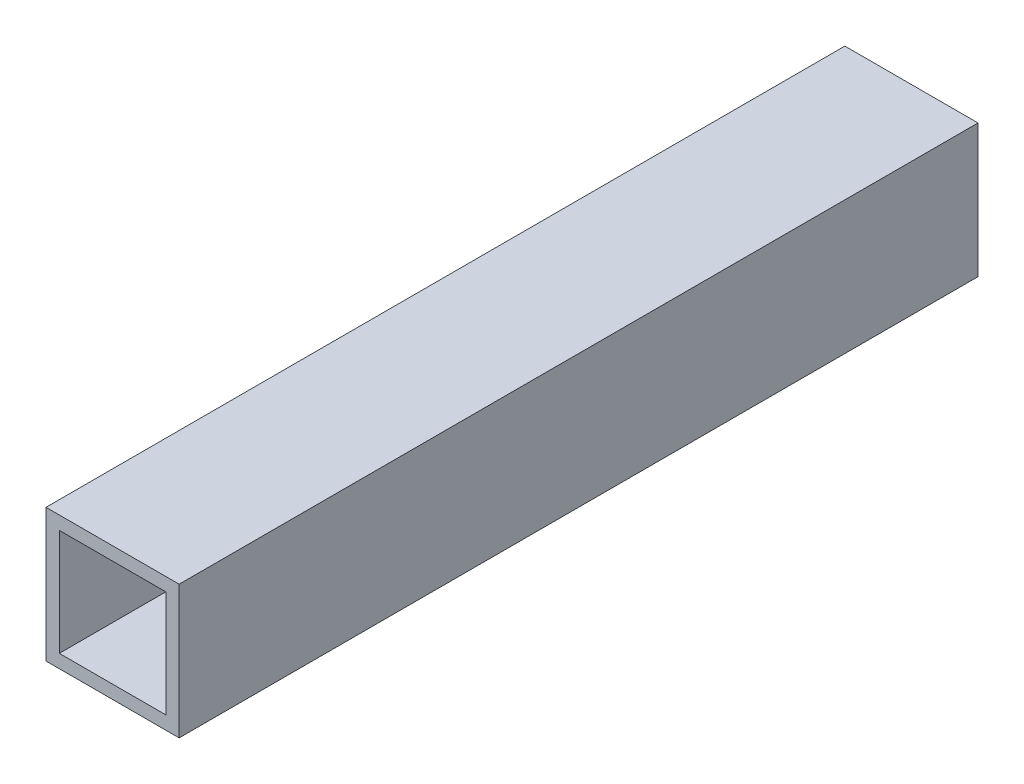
ISO-10303-21;
HEADER;
FILE_DESCRIPTION(('STEP AP214'),'2;1');
FILE_NAME('part.step','',(''),(''),'','','');
FILE_SCHEMA(('AUTOMOTIVE_DESIGN { 1 0 10303 214 1 1 1 1 }'));
ENDSEC;
DATA;
#1=APPLICATION_CONTEXT('core data for automotive mechanical design processes');
#2=APPLICATION_PROTOCOL_DEFINITION('international standard','automotive_design',2000,#1);
#3=PRODUCT_CONTEXT('',#1,'mechanical');
#4=PRODUCT('Part','Part','',(#3));
#5=PRODUCT_RELATED_PRODUCT_CATEGORY('part','',(#4));
#6=PRODUCT_DEFINITION_FORMATION('','',#4);
#7=PRODUCT_DEFINITION_CONTEXT('part definition',#1,'design');
#8=PRODUCT_DEFINITION('design','',#6,#7);
#9=PRODUCT_DEFINITION_SHAPE('','',#8);
#10=(LENGTH_UNIT() NAMED_UNIT(*) SI_UNIT(.MILLI.,.METRE.));
#11=(NAMED_UNIT(*) PLANE_ANGLE_UNIT() SI_UNIT($,.RADIAN.));
#12=(NAMED_UNIT(*) SI_UNIT($,.STERADIAN.) SOLID_ANGLE_UNIT());
#13=UNCERTAINTY_MEASURE_WITH_UNIT(LENGTH_MEASURE(1.E-05),#10,'distance_accuracy_value','');
#14=(GEOMETRIC_REPRESENTATION_CONTEXT(3) GLOBAL_UNCERTAINTY_ASSIGNED_CONTEXT((#13)) GLOBAL_UNIT_ASSIGNED_CONTEXT((#10,
#11,#12)) REPRESENTATION_CONTEXT('',''));
#15=CARTESIAN_POINT('',(0.,0.,0.));
#16=DIRECTION('',(0.,0.,1.));
#17=DIRECTION('',(1.,0.,0.));
#18=AXIS2_PLACEMENT_3D('',#15,#16,#17);
#19=CARTESIAN_POINT('',(0.,0.,300.));
#20=DIRECTION('',(0.,0.,1.));
#21=DIRECTION('',(1.,0.,0.));
#22=AXIS2_PLACEMENT_3D('',#19,#20,#21);
#23=PLANE('',#22);
#24=DIRECTION('',(0.,1.,0.));
#25=VECTOR('',#24,1.);
#26=CARTESIAN_POINT('',(0.,0.,300.));
#27=LINE('',#26,#25);
#28=CARTESIAN_POINT('',(0.,0.,300.));
#29=VERTEX_POINT('',#28);
#30=CARTESIAN_POINT('',(0.,50.,300.));
#31=VERTEX_POINT('',#30);
#32=EDGE_CURVE('E136',#29,#31,#27,.T.);
#33=ORIENTED_EDGE('',*,*,#32,.T.);
#34=DIRECTION('',(-1.,0.,0.));
#35=VECTOR('',#34,1.);
#36=CARTESIAN_POINT('',(0.,50.,300.));
#37=LINE('',#36,#35);
#38=CARTESIAN_POINT('',(-50.,50.,300.));
#39=VERTEX_POINT('',#38);
#40=EDGE_CURVE('E139',#31,#39,#37,.T.);
#41=ORIENTED_EDGE('',*,*,#40,.T.);
#42=DIRECTION('',(0.,-1.,0.));
#43=VECTOR('',#42,1.);
#44=CARTESIAN_POINT('',(-50.,0.,300.));
#45=LINE('',#44,#43);
#46=CARTESIAN_POINT('',(-50.,0.,300.));
#47=VERTEX_POINT('',#46);
#48=EDGE_CURVE('E142',#39,#47,#45,.T.);
#49=ORIENTED_EDGE('',*,*,#48,.T.);
#50=DIRECTION('',(1.,0.,0.));
#51=VECTOR('',#50,1.);
#52=CARTESIAN_POINT('',(0.,0.,300.));
#53=LINE('',#52,#51);
#54=EDGE_CURVE('E144',#47,#29,#53,.T.);
#55=ORIENTED_EDGE('',*,*,#54,.T.);
#56=EDGE_LOOP('',(#33,#41,#49,#55));
#57=FACE_BOUND('',#56,.T.);
#58=DIRECTION('',(-1.,0.,0.));
#59=VECTOR('',#58,1.);
#60=CARTESIAN_POINT('',(-5.,45.,300.));
#61=LINE('',#60,#59);
#62=CARTESIAN_POINT('',(-5.,45.,300.));
#63=VERTEX_POINT('',#62);
#64=CARTESIAN_POINT('',(-45.,45.,300.));
#65=VERTEX_POINT('',#64);
#66=EDGE_CURVE('E108',#63,#65,#61,.T.);
#67=ORIENTED_EDGE('',*,*,#66,.F.);
#68=DIRECTION('',(0.,1.,0.));
#69=VECTOR('',#68,1.);
#70=CARTESIAN_POINT('',(-5.,5.,300.));
#71=LINE('',#70,#69);
#72=CARTESIAN_POINT('',(-5.,5.,300.));
#73=VERTEX_POINT('',#72);
#74=EDGE_CURVE('E100',#73,#63,#71,.T.);
#75=ORIENTED_EDGE('',*,*,#74,.F.);
#76=DIRECTION('',(1.,0.,0.));
#77=VECTOR('',#76,1.);
#78=CARTESIAN_POINT('',(-5.,5.,300.));
#79=LINE('',#78,#77);
#80=CARTESIAN_POINT('',(-45.,5.,300.));
#81=VERTEX_POINT('',#80);
#82=EDGE_CURVE('E122',#81,#73,#79,.T.);
#83=ORIENTED_EDGE('',*,*,#82,.F.);
#84=DIRECTION('',(0.,-1.,0.));
#85=VECTOR('',#84,1.);
#86=CARTESIAN_POINT('',(-45.,5.,300.));
#87=LINE('',#86,#85);
#88=EDGE_CURVE('E120',#65,#81,#87,.T.);
#89=ORIENTED_EDGE('',*,*,#88,.F.);
#90=EDGE_LOOP('',(#67,#75,#83,#89));
#91=FACE_BOUND('',#90,.T.);
#92=ADVANCED_FACE('F35',(#57,#91),#23,.T.);
#93=CARTESIAN_POINT('',(0.,0.,0.));
#94=DIRECTION('',(0.,0.,1.));
#95=DIRECTION('',(1.,0.,0.));
#96=AXIS2_PLACEMENT_3D('',#93,#94,#95);
#97=PLANE('',#96);
#98=DIRECTION('',(0.,1.,0.));
#99=VECTOR('',#98,1.);
#100=CARTESIAN_POINT('',(0.,0.,0.));
#101=LINE('',#100,#99);
#102=CARTESIAN_POINT('',(0.,0.,0.));
#103=VERTEX_POINT('',#102);
#104=CARTESIAN_POINT('',(0.,50.,0.));
#105=VERTEX_POINT('',#104);
#106=EDGE_CURVE('E116',#103,#105,#101,.T.);
#107=ORIENTED_EDGE('',*,*,#106,.F.);
#108=DIRECTION('',(1.,0.,0.));
#109=VECTOR('',#108,1.);
#110=CARTESIAN_POINT('',(0.,0.,0.));
#111=LINE('',#110,#109);
#112=CARTESIAN_POINT('',(-50.,0.,0.));
#113=VERTEX_POINT('',#112);
#114=EDGE_CURVE('E140',#113,#103,#111,.T.);
#115=ORIENTED_EDGE('',*,*,#114,.F.);
#116=DIRECTION('',(0.,-1.,0.));
#117=VECTOR('',#116,1.);
#118=CARTESIAN_POINT('',(-50.,0.,0.));
#119=LINE('',#118,#117);
#120=CARTESIAN_POINT('',(-50.,50.,0.));
#121=VERTEX_POINT('',#120);
#122=EDGE_CURVE('E151',#121,#113,#119,.T.);
#123=ORIENTED_EDGE('',*,*,#122,.F.);
#124=DIRECTION('',(-1.,0.,0.));
#125=VECTOR('',#124,1.);
#126=CARTESIAN_POINT('',(0.,50.,0.));
#127=LINE('',#126,#125);
#128=EDGE_CURVE('E149',#105,#121,#127,.T.);
#129=ORIENTED_EDGE('',*,*,#128,.F.);
#130=EDGE_LOOP('',(#107,#115,#123,#129));
#131=FACE_BOUND('',#130,.T.);
#132=DIRECTION('',(0.,1.,0.));
#133=VECTOR('',#132,1.);
#134=CARTESIAN_POINT('',(-5.,5.,0.));
#135=LINE('',#134,#133);
#136=CARTESIAN_POINT('',(-5.,5.,0.));
#137=VERTEX_POINT('',#136);
#138=CARTESIAN_POINT('',(-5.,45.,0.));
#139=VERTEX_POINT('',#138);
#140=EDGE_CURVE('E58',#137,#139,#135,.T.);
#141=ORIENTED_EDGE('',*,*,#140,.T.);
#142=DIRECTION('',(-1.,0.,0.));
#143=VECTOR('',#142,1.);
#144=CARTESIAN_POINT('',(-5.,45.,0.));
#145=LINE('',#144,#143);
#146=CARTESIAN_POINT('',(-45.,45.,0.));
#147=VERTEX_POINT('',#146);
#148=EDGE_CURVE('E115',#139,#147,#145,.T.);
#149=ORIENTED_EDGE('',*,*,#148,.T.);
#150=DIRECTION('',(0.,-1.,0.));
#151=VECTOR('',#150,1.);
#152=CARTESIAN_POINT('',(-45.,5.,0.));
#153=LINE('',#152,#151);
#154=CARTESIAN_POINT('',(-45.,5.,0.));
#155=VERTEX_POINT('',#154);
#156=EDGE_CURVE('E128',#147,#155,#153,.T.);
#157=ORIENTED_EDGE('',*,*,#156,.T.);
#158=DIRECTION('',(1.,0.,0.));
#159=VECTOR('',#158,1.);
#160=CARTESIAN_POINT('',(-5.,5.,0.));
#161=LINE('',#160,#159);
#162=EDGE_CURVE('E109',#155,#137,#161,.T.);
#163=ORIENTED_EDGE('',*,*,#162,.T.);
#164=EDGE_LOOP('',(#141,#149,#157,#163));
#165=FACE_BOUND('',#164,.T.);
#166=ADVANCED_FACE('F169',(#131,#165),#97,.F.);
#167=CARTESIAN_POINT('',(0.,0.,300.));
#168=DIRECTION('',(-1.,0.,0.));
#169=DIRECTION('',(0.,0.,1.));
#170=AXIS2_PLACEMENT_3D('',#167,#168,#169);
#171=PLANE('',#170);
#172=ORIENTED_EDGE('',*,*,#106,.T.);
#173=DIRECTION('',(0.,0.,-1.));
#174=VECTOR('',#173,1.);
#175=CARTESIAN_POINT('',(0.,50.,300.));
#176=LINE('',#175,#174);
#177=EDGE_CURVE('E11',#31,#105,#176,.T.);
#178=ORIENTED_EDGE('',*,*,#177,.F.);
#179=ORIENTED_EDGE('',*,*,#32,.F.);
#180=DIRECTION('',(0.,0.,-1.));
#181=VECTOR('',#180,1.);
#182=CARTESIAN_POINT('',(0.,0.,300.));
#183=LINE('',#182,#181);
#184=EDGE_CURVE('E146',#29,#103,#183,.T.);
#185=ORIENTED_EDGE('',*,*,#184,.T.);
#186=EDGE_LOOP('',(#172,#178,#179,#185));
#187=FACE_BOUND('',#186,.T.);
#188=ADVANCED_FACE('F37',(#187),#171,.F.);
#189=CARTESIAN_POINT('',(0.,50.,300.));
#190=DIRECTION('',(0.,-1.,0.));
#191=DIRECTION('',(1.,0.,0.));
#192=AXIS2_PLACEMENT_3D('',#189,#190,#191);
#193=PLANE('',#192);
#194=ORIENTED_EDGE('',*,*,#128,.T.);
#195=DIRECTION('',(0.,0.,-1.));
#196=VECTOR('',#195,1.);
#197=CARTESIAN_POINT('',(-50.,50.,300.));
#198=LINE('',#197,#196);
#199=EDGE_CURVE('E43',#39,#121,#198,.T.);
#200=ORIENTED_EDGE('',*,*,#199,.F.);
#201=ORIENTED_EDGE('',*,*,#40,.F.);
#202=ORIENTED_EDGE('',*,*,#177,.T.);
#203=EDGE_LOOP('',(#194,#200,#201,#202));
#204=FACE_BOUND('',#203,.T.);
#205=ADVANCED_FACE('F179',(#204),#193,.F.);
#206=CARTESIAN_POINT('',(-50.,0.,300.));
#207=DIRECTION('',(1.,0.,0.));
#208=DIRECTION('',(0.,0.,-1.));
#209=AXIS2_PLACEMENT_3D('',#206,#207,#208);
#210=PLANE('',#209);
#211=ORIENTED_EDGE('',*,*,#122,.T.);
#212=DIRECTION('',(0.,0.,-1.));
#213=VECTOR('',#212,1.);
#214=CARTESIAN_POINT('',(-50.,0.,300.));
#215=LINE('',#214,#213);
#216=EDGE_CURVE('E156',#47,#113,#215,.T.);
#217=ORIENTED_EDGE('',*,*,#216,.F.);
#218=ORIENTED_EDGE('',*,*,#48,.F.);
#219=ORIENTED_EDGE('',*,*,#199,.T.);
#220=EDGE_LOOP('',(#211,#217,#218,#219));
#221=FACE_BOUND('',#220,.T.);
#222=ADVANCED_FACE('F163',(#221),#210,.F.);
#223=CARTESIAN_POINT('',(0.,0.,300.));
#224=DIRECTION('',(0.,1.,0.));
#225=DIRECTION('',(-1.,0.,0.));
#226=AXIS2_PLACEMENT_3D('',#223,#224,#225);
#227=PLANE('',#226);
#228=ORIENTED_EDGE('',*,*,#114,.T.);
#229=ORIENTED_EDGE('',*,*,#184,.F.);
#230=ORIENTED_EDGE('',*,*,#54,.F.);
#231=ORIENTED_EDGE('',*,*,#216,.T.);
#232=EDGE_LOOP('',(#228,#229,#230,#231));
#233=FACE_BOUND('',#232,.T.);
#234=ADVANCED_FACE('F173',(#233),#227,.F.);
#235=CARTESIAN_POINT('',(-5.,5.,300.));
#236=DIRECTION('',(-1.,0.,0.));
#237=DIRECTION('',(0.,-1.,0.));
#238=AXIS2_PLACEMENT_3D('',#235,#236,#237);
#239=PLANE('',#238);
#240=ORIENTED_EDGE('',*,*,#140,.F.);
#241=DIRECTION('',(0.,0.,-1.));
#242=VECTOR('',#241,1.);
#243=CARTESIAN_POINT('',(-5.,5.,300.));
#244=LINE('',#243,#242);
#245=EDGE_CURVE('E104',#73,#137,#244,.T.);
#246=ORIENTED_EDGE('',*,*,#245,.F.);
#247=ORIENTED_EDGE('',*,*,#74,.T.);
#248=DIRECTION('',(0.,0.,-1.));
#249=VECTOR('',#248,1.);
#250=CARTESIAN_POINT('',(-5.,45.,300.));
#251=LINE('',#250,#249);
#252=EDGE_CURVE('E103',#63,#139,#251,.T.);
#253=ORIENTED_EDGE('',*,*,#252,.T.);
#254=EDGE_LOOP('',(#240,#246,#247,#253));
#255=FACE_BOUND('',#254,.T.);
#256=ADVANCED_FACE('F102',(#255),#239,.T.);
#257=CARTESIAN_POINT('',(-5.,45.,300.));
#258=DIRECTION('',(0.,-1.,0.));
#259=DIRECTION('',(1.,0.,0.));
#260=AXIS2_PLACEMENT_3D('',#257,#258,#259);
#261=PLANE('',#260);
#262=ORIENTED_EDGE('',*,*,#148,.F.);
#263=ORIENTED_EDGE('',*,*,#252,.F.);
#264=ORIENTED_EDGE('',*,*,#66,.T.);
#265=DIRECTION('',(0.,0.,-1.));
#266=VECTOR('',#265,1.);
#267=CARTESIAN_POINT('',(-45.,45.,300.));
#268=LINE('',#267,#266);
#269=EDGE_CURVE('E117',#65,#147,#268,.T.);
#270=ORIENTED_EDGE('',*,*,#269,.T.);
#271=EDGE_LOOP('',(#262,#263,#264,#270));
#272=FACE_BOUND('',#271,.T.);
#273=ADVANCED_FACE('F112',(#272),#261,.T.);
#274=CARTESIAN_POINT('',(-45.,5.,300.));
#275=DIRECTION('',(1.,0.,0.));
#276=DIRECTION('',(0.,0.,-1.));
#277=AXIS2_PLACEMENT_3D('',#274,#275,#276);
#278=PLANE('',#277);
#279=ORIENTED_EDGE('',*,*,#156,.F.);
#280=ORIENTED_EDGE('',*,*,#269,.F.);
#281=ORIENTED_EDGE('',*,*,#88,.T.);
#282=DIRECTION('',(0.,0.,-1.));
#283=VECTOR('',#282,1.);
#284=CARTESIAN_POINT('',(-45.,5.,300.));
#285=LINE('',#284,#283);
#286=EDGE_CURVE('E50',#81,#155,#285,.T.);
#287=ORIENTED_EDGE('',*,*,#286,.T.);
#288=EDGE_LOOP('',(#279,#280,#281,#287));
#289=FACE_BOUND('',#288,.T.);
#290=ADVANCED_FACE('F202',(#289),#278,.T.);
#291=CARTESIAN_POINT('',(-5.,5.,300.));
#292=DIRECTION('',(0.,1.,0.));
#293=DIRECTION('',(0.,0.,1.));
#294=AXIS2_PLACEMENT_3D('',#291,#292,#293);
#295=PLANE('',#294);
#296=ORIENTED_EDGE('',*,*,#162,.F.);
#297=ORIENTED_EDGE('',*,*,#286,.F.);
#298=ORIENTED_EDGE('',*,*,#82,.T.);
#299=ORIENTED_EDGE('',*,*,#245,.T.);
#300=EDGE_LOOP('',(#296,#297,#298,#299));
#301=FACE_BOUND('',#300,.T.);
#302=ADVANCED_FACE('F206',(#301),#295,.T.);
#303=CLOSED_SHELL('',(#92,#166,#188,#205,#222,#234,#256,#273,#290,#302));
#304=MANIFOLD_SOLID_BREP('B2',#303);
#305=ADVANCED_BREP_SHAPE_REPRESENTATION('',(#18,#304),#14);
#306=SHAPE_DEFINITION_REPRESENTATION(#9,#305);
ENDSEC;
END-ISO-10303-21;
